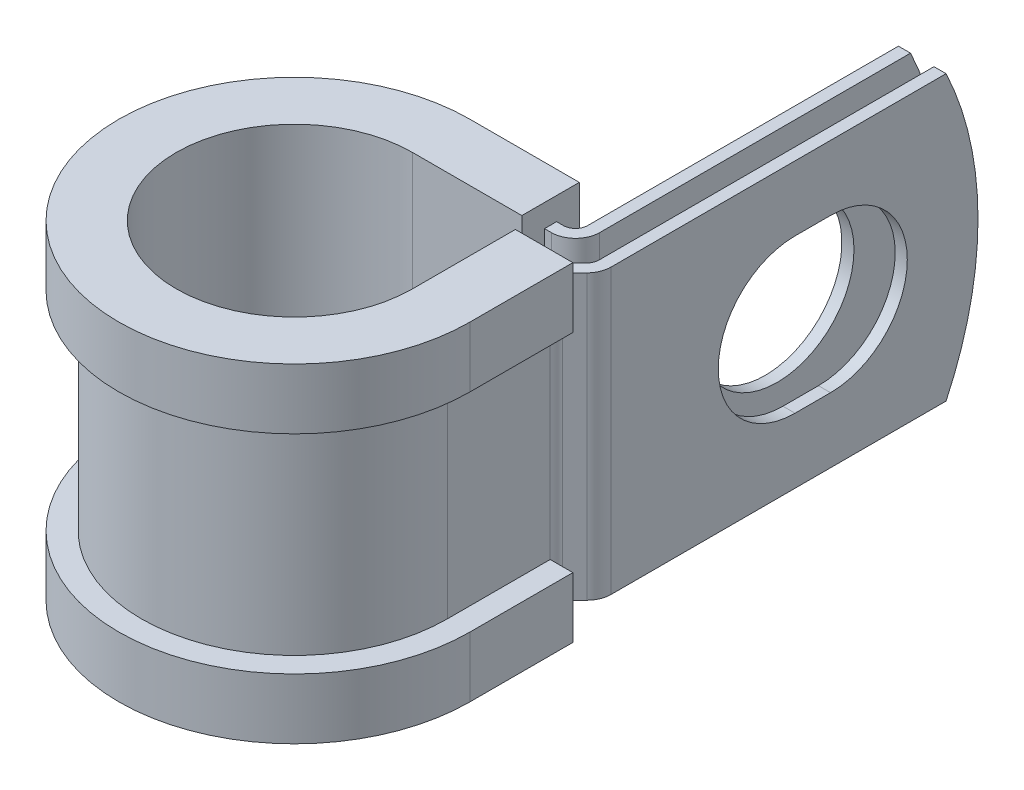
ISO-10303-21;
HEADER;
FILE_DESCRIPTION(('STEP AP214'),'2;1');
FILE_NAME('part.step','',(''),(''),'','','');
FILE_SCHEMA(('AUTOMOTIVE_DESIGN { 1 0 10303 214 1 1 1 1 }'));
ENDSEC;
DATA;
#1=APPLICATION_CONTEXT('core data for automotive mechanical design processes');
#2=APPLICATION_PROTOCOL_DEFINITION('international standard','automotive_design',2000,#1);
#3=PRODUCT_CONTEXT('',#1,'mechanical');
#4=PRODUCT('Part','Part','',(#3));
#5=PRODUCT_RELATED_PRODUCT_CATEGORY('part','',(#4));
#6=PRODUCT_DEFINITION_FORMATION('','',#4);
#7=PRODUCT_DEFINITION_CONTEXT('part definition',#1,'design');
#8=PRODUCT_DEFINITION('design','',#6,#7);
#9=PRODUCT_DEFINITION_SHAPE('','',#8);
#10=(LENGTH_UNIT() NAMED_UNIT(*) SI_UNIT(.MILLI.,.METRE.));
#11=(NAMED_UNIT(*) PLANE_ANGLE_UNIT() SI_UNIT($,.RADIAN.));
#12=(NAMED_UNIT(*) SI_UNIT($,.STERADIAN.) SOLID_ANGLE_UNIT());
#13=UNCERTAINTY_MEASURE_WITH_UNIT(LENGTH_MEASURE(1.E-05),#10,'distance_accuracy_value','');
#14=(GEOMETRIC_REPRESENTATION_CONTEXT(3) GLOBAL_UNCERTAINTY_ASSIGNED_CONTEXT((#13)) GLOBAL_UNIT_ASSIGNED_CONTEXT((#10,
#11,#12)) REPRESENTATION_CONTEXT('',''));
#15=CARTESIAN_POINT('',(0.,0.,0.));
#16=DIRECTION('',(0.,0.,1.));
#17=DIRECTION('',(1.,0.,0.));
#18=AXIS2_PLACEMENT_3D('',#15,#16,#17);
#19=CARTESIAN_POINT('',(10.1890743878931,-9.525,-9.4615));
#20=DIRECTION('',(0.,1.,0.));
#21=DIRECTION('',(1.,0.,0.));
#22=AXIS2_PLACEMENT_3D('',#19,#20,#21);
#23=PLANE('',#22);
#24=DIRECTION('',(0.,0.,-1.));
#25=VECTOR('',#24,1.);
#26=CARTESIAN_POINT('',(7.34427438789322,-9.525,-9.4615));
#27=LINE('',#26,#25);
#28=CARTESIAN_POINT('',(7.34427438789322,-9.525,-9.4615));
#29=VERTEX_POINT('',#28);
#30=CARTESIAN_POINT('',(7.34427438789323,-9.525,-10.2743));
#31=VERTEX_POINT('',#30);
#32=EDGE_CURVE('E523',#29,#31,#27,.T.);
#33=ORIENTED_EDGE('',*,*,#32,.T.);
#34=DIRECTION('',(-1.,0.,0.));
#35=VECTOR('',#34,1.);
#36=CARTESIAN_POINT('',(0.,-9.525,-10.2743));
#37=LINE('',#36,#35);
#38=CARTESIAN_POINT('',(7.80147438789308,-9.525,-10.2743));
#39=VERTEX_POINT('',#38);
#40=EDGE_CURVE('E410',#39,#31,#37,.T.);
#41=ORIENTED_EDGE('',*,*,#40,.F.);
#42=CARTESIAN_POINT('',(7.80147438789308,-9.525,-11.0871));
#43=DIRECTION('',(0.,1.,0.));
#44=DIRECTION('',(1.,0.,0.));
#45=AXIS2_PLACEMENT_3D('',#42,#43,#44);
#46=CIRCLE('',#45,0.812799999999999);
#47=CARTESIAN_POINT('',(8.61427438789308,-9.525,-11.0871));
#48=VERTEX_POINT('',#47);
#49=EDGE_CURVE('E408',#48,#39,#46,.F.);
#50=ORIENTED_EDGE('',*,*,#49,.F.);
#51=DIRECTION('',(0.,0.,1.));
#52=VECTOR('',#51,1.);
#53=CARTESIAN_POINT('',(8.61427438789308,-9.525,-34.1122));
#54=LINE('',#53,#52);
#55=CARTESIAN_POINT('',(8.61427438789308,-9.525,-31.9676631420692));
#56=VERTEX_POINT('',#55);
#57=EDGE_CURVE('E406',#56,#48,#54,.T.);
#58=ORIENTED_EDGE('',*,*,#57,.F.);
#59=DIRECTION('',(-1.,0.,0.));
#60=VECTOR('',#59,1.);
#61=CARTESIAN_POINT('',(11.8146743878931,-9.525,-31.9676631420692));
#62=LINE('',#61,#60);
#63=CARTESIAN_POINT('',(9.42707438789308,-9.525,-31.9676631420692));
#64=VERTEX_POINT('',#63);
#65=EDGE_CURVE('E12',#64,#56,#62,.T.);
#66=ORIENTED_EDGE('',*,*,#65,.F.);
#67=DIRECTION('',(0.,0.,1.));
#68=VECTOR('',#67,1.);
#69=CARTESIAN_POINT('',(9.42707438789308,-9.525,-34.1122));
#70=LINE('',#69,#68);
#71=CARTESIAN_POINT('',(9.42707438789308,-9.525,-11.0871));
#72=VERTEX_POINT('',#71);
#73=EDGE_CURVE('E404',#64,#72,#70,.T.);
#74=ORIENTED_EDGE('',*,*,#73,.T.);
#75=CARTESIAN_POINT('',(7.80147438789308,-9.525,-11.0871));
#76=DIRECTION('',(0.,-1.,0.));
#77=DIRECTION('',(0.,0.,1.));
#78=AXIS2_PLACEMENT_3D('',#75,#76,#77);
#79=CIRCLE('',#78,1.6256);
#80=CARTESIAN_POINT('',(7.80147438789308,-9.525,-9.4615));
#81=VERTEX_POINT('',#80);
#82=EDGE_CURVE('E401',#72,#81,#79,.T.);
#83=ORIENTED_EDGE('',*,*,#82,.T.);
#84=DIRECTION('',(-1.,0.,0.));
#85=VECTOR('',#84,1.);
#86=CARTESIAN_POINT('',(0.,-9.525,-9.4615));
#87=LINE('',#86,#85);
#88=EDGE_CURVE('E398',#81,#29,#87,.T.);
#89=ORIENTED_EDGE('',*,*,#88,.T.);
#90=EDGE_LOOP('',(#33,#41,#50,#58,#66,#74,#83,#89));
#91=FACE_BOUND('',#90,.T.);
#92=ADVANCED_FACE('F54',(#91),#23,.F.);
#93=CARTESIAN_POINT('',(10.1890743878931,9.525,-9.4615));
#94=DIRECTION('',(0.,1.,0.));
#95=DIRECTION('',(1.,0.,0.));
#96=AXIS2_PLACEMENT_3D('',#93,#94,#95);
#97=PLANE('',#96);
#98=DIRECTION('',(-1.,0.,0.));
#99=VECTOR('',#98,1.);
#100=CARTESIAN_POINT('',(0.,9.525,-10.2743));
#101=LINE('',#100,#99);
#102=CARTESIAN_POINT('',(7.80147438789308,9.525,-10.2743));
#103=VERTEX_POINT('',#102);
#104=CARTESIAN_POINT('',(7.34427438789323,9.525,-10.2743));
#105=VERTEX_POINT('',#104);
#106=EDGE_CURVE('E368',#103,#105,#101,.T.);
#107=ORIENTED_EDGE('',*,*,#106,.T.);
#108=DIRECTION('',(0.,0.,1.));
#109=VECTOR('',#108,1.);
#110=CARTESIAN_POINT('',(7.34427438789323,9.525,-10.2743));
#111=LINE('',#110,#109);
#112=CARTESIAN_POINT('',(7.34427438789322,9.525,-9.4615));
#113=VERTEX_POINT('',#112);
#114=EDGE_CURVE('E517',#105,#113,#111,.T.);
#115=ORIENTED_EDGE('',*,*,#114,.T.);
#116=DIRECTION('',(-1.,0.,0.));
#117=VECTOR('',#116,1.);
#118=CARTESIAN_POINT('',(0.,9.525,-9.4615));
#119=LINE('',#118,#117);
#120=CARTESIAN_POINT('',(7.80147438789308,9.525,-9.4615));
#121=VERTEX_POINT('',#120);
#122=EDGE_CURVE('E625',#121,#113,#119,.T.);
#123=ORIENTED_EDGE('',*,*,#122,.F.);
#124=CARTESIAN_POINT('',(7.80147438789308,9.525,-11.0871));
#125=DIRECTION('',(0.,-1.,0.));
#126=DIRECTION('',(0.,0.,1.));
#127=AXIS2_PLACEMENT_3D('',#124,#125,#126);
#128=CIRCLE('',#127,1.6256);
#129=CARTESIAN_POINT('',(9.42707438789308,9.525,-11.0871));
#130=VERTEX_POINT('',#129);
#131=EDGE_CURVE('E370',#130,#121,#128,.T.);
#132=ORIENTED_EDGE('',*,*,#131,.F.);
#133=DIRECTION('',(0.,0.,1.));
#134=VECTOR('',#133,1.);
#135=CARTESIAN_POINT('',(9.42707438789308,9.525,-34.1122));
#136=LINE('',#135,#134);
#137=CARTESIAN_POINT('',(9.42707438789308,9.525,-31.9676631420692));
#138=VERTEX_POINT('',#137);
#139=EDGE_CURVE('E361',#138,#130,#136,.T.);
#140=ORIENTED_EDGE('',*,*,#139,.F.);
#141=DIRECTION('',(-1.,0.,0.));
#142=VECTOR('',#141,1.);
#143=CARTESIAN_POINT('',(11.8146743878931,9.525,-31.9676631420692));
#144=LINE('',#143,#142);
#145=CARTESIAN_POINT('',(8.61427438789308,9.525,-31.9676631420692));
#146=VERTEX_POINT('',#145);
#147=EDGE_CURVE('E62',#138,#146,#144,.T.);
#148=ORIENTED_EDGE('',*,*,#147,.T.);
#149=DIRECTION('',(0.,0.,1.));
#150=VECTOR('',#149,1.);
#151=CARTESIAN_POINT('',(8.61427438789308,9.525,-34.1122));
#152=LINE('',#151,#150);
#153=CARTESIAN_POINT('',(8.61427438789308,9.525,-11.0871));
#154=VERTEX_POINT('',#153);
#155=EDGE_CURVE('E358',#146,#154,#152,.T.);
#156=ORIENTED_EDGE('',*,*,#155,.T.);
#157=CARTESIAN_POINT('',(7.80147438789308,9.525,-11.0871));
#158=DIRECTION('',(0.,1.,0.));
#159=DIRECTION('',(1.,0.,0.));
#160=AXIS2_PLACEMENT_3D('',#157,#158,#159);
#161=CIRCLE('',#160,0.812799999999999);
#162=EDGE_CURVE('E366',#154,#103,#161,.F.);
#163=ORIENTED_EDGE('',*,*,#162,.T.);
#164=EDGE_LOOP('',(#107,#115,#123,#132,#140,#148,#156,#163));
#165=FACE_BOUND('',#164,.T.);
#166=ADVANCED_FACE('F357',(#165),#97,.T.);
#167=CARTESIAN_POINT('',(0.,9.525,-9.4615));
#168=DIRECTION('',(0.,0.,1.));
#169=DIRECTION('',(1.,0.,0.));
#170=AXIS2_PLACEMENT_3D('',#167,#168,#169);
#171=PLANE('',#170);
#172=ORIENTED_EDGE('',*,*,#122,.T.);
#173=DIRECTION('',(0.,-1.,0.));
#174=VECTOR('',#173,1.);
#175=CARTESIAN_POINT('',(7.34427438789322,9.525,-9.4615));
#176=LINE('',#175,#174);
#177=EDGE_CURVE('E520',#113,#29,#176,.T.);
#178=ORIENTED_EDGE('',*,*,#177,.T.);
#179=ORIENTED_EDGE('',*,*,#88,.F.);
#180=DIRECTION('',(0.,-1.,0.));
#181=VECTOR('',#180,1.);
#182=CARTESIAN_POINT('',(7.80147438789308,9.525,-9.4615));
#183=LINE('',#182,#181);
#184=EDGE_CURVE('E344',#121,#81,#183,.T.);
#185=ORIENTED_EDGE('',*,*,#184,.F.);
#186=EDGE_LOOP('',(#172,#178,#179,#185));
#187=FACE_BOUND('',#186,.T.);
#188=ADVANCED_FACE('F635',(#187),#171,.T.);
#189=CARTESIAN_POINT('',(11.8146743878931,9.525,-9.4615));
#190=DIRECTION('',(-1.,0.,0.));
#191=DIRECTION('',(0.,0.,1.));
#192=AXIS2_PLACEMENT_3D('',#189,#190,#191);
#193=PLANE('',#192);
#194=CARTESIAN_POINT('',(11.8146743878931,0.,-24.2061999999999));
#195=DIRECTION('',(1.,0.,0.));
#196=DIRECTION('',(0.,0.,-1.));
#197=AXIS2_PLACEMENT_3D('',#194,#195,#196);
#198=CIRCLE('',#197,5.1562);
#199=CARTESIAN_POINT('',(11.8146743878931,-5.1562,-24.2062000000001));
#200=VERTEX_POINT('',#199);
#201=CARTESIAN_POINT('',(11.8146743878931,5.1562,-24.2062000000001));
#202=VERTEX_POINT('',#201);
#203=EDGE_CURVE('E580',#200,#202,#198,.T.);
#204=ORIENTED_EDGE('',*,*,#203,.F.);
#205=DIRECTION('',(0.,0.,-1.));
#206=VECTOR('',#205,1.);
#207=CARTESIAN_POINT('',(11.8146743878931,-5.1562,-21.8185999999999));
#208=LINE('',#207,#206);
#209=CARTESIAN_POINT('',(11.8146743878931,-5.1562,-21.8185999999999));
#210=VERTEX_POINT('',#209);
#211=EDGE_CURVE('E583',#210,#200,#208,.T.);
#212=ORIENTED_EDGE('',*,*,#211,.F.);
#213=CARTESIAN_POINT('',(11.8146743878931,0.,-21.8185999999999));
#214=DIRECTION('',(1.,0.,0.));
#215=DIRECTION('',(0.,0.,-1.));
#216=AXIS2_PLACEMENT_3D('',#213,#214,#215);
#217=CIRCLE('',#216,5.1562);
#218=CARTESIAN_POINT('',(11.8146743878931,5.1562,-21.8185999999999));
#219=VERTEX_POINT('',#218);
#220=EDGE_CURVE('E576',#219,#210,#217,.T.);
#221=ORIENTED_EDGE('',*,*,#220,.F.);
#222=DIRECTION('',(0.,0.,1.));
#223=VECTOR('',#222,1.);
#224=CARTESIAN_POINT('',(11.8146743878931,5.1562,-21.8185999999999));
#225=LINE('',#224,#223);
#226=EDGE_CURVE('E577',#202,#219,#225,.T.);
#227=ORIENTED_EDGE('',*,*,#226,.F.);
#228=EDGE_LOOP('',(#204,#212,#221,#227));
#229=FACE_BOUND('',#228,.T.);
#230=DIRECTION('',(0.,0.,-1.));
#231=VECTOR('',#230,1.);
#232=CARTESIAN_POINT('',(11.8146743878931,-9.525,-9.4615));
#233=LINE('',#232,#231);
#234=CARTESIAN_POINT('',(11.8146743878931,-9.525,-9.4615));
#235=VERTEX_POINT('',#234);
#236=CARTESIAN_POINT('',(11.8146743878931,-9.525,-31.9676631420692));
#237=VERTEX_POINT('',#236);
#238=EDGE_CURVE('E382',#235,#237,#233,.T.);
#239=ORIENTED_EDGE('',*,*,#238,.T.);
#240=CARTESIAN_POINT('',(11.8146743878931,0.,-11.8872));
#241=DIRECTION('',(-1.,0.,0.));
#242=DIRECTION('',(0.,0.,1.));
#243=AXIS2_PLACEMENT_3D('',#240,#241,#242);
#244=CIRCLE('',#243,22.225);
#245=CARTESIAN_POINT('',(11.8146743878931,9.525,-31.9676631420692));
#246=VERTEX_POINT('',#245);
#247=EDGE_CURVE('E568',#246,#237,#244,.T.);
#248=ORIENTED_EDGE('',*,*,#247,.F.);
#249=DIRECTION('',(0.,0.,-1.));
#250=VECTOR('',#249,1.);
#251=CARTESIAN_POINT('',(11.8146743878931,9.525,-9.4615));
#252=LINE('',#251,#250);
#253=CARTESIAN_POINT('',(11.8146743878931,9.525,-9.4615));
#254=VERTEX_POINT('',#253);
#255=EDGE_CURVE('E419',#254,#246,#252,.T.);
#256=ORIENTED_EDGE('',*,*,#255,.F.);
#257=DIRECTION('',(0.,-1.,0.));
#258=VECTOR('',#257,1.);
#259=CARTESIAN_POINT('',(11.8146743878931,9.525,-9.4615));
#260=LINE('',#259,#258);
#261=EDGE_CURVE('E381',#254,#235,#260,.T.);
#262=ORIENTED_EDGE('',*,*,#261,.T.);
#263=EDGE_LOOP('',(#239,#248,#256,#262));
#264=FACE_BOUND('',#263,.T.);
#265=ADVANCED_FACE('F56',(#229,#264),#193,.F.);
#266=CARTESIAN_POINT('',(11.0018743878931,9.525,-9.4615));
#267=DIRECTION('',(-1.,0.,0.));
#268=DIRECTION('',(0.,0.,1.));
#269=AXIS2_PLACEMENT_3D('',#266,#267,#268);
#270=PLANE('',#269);
#271=DIRECTION('',(0.,0.,-1.));
#272=VECTOR('',#271,1.);
#273=CARTESIAN_POINT('',(11.0018743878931,-5.1562,-21.8185999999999));
#274=LINE('',#273,#272);
#275=CARTESIAN_POINT('',(11.0018743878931,-5.1562,-21.8185999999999));
#276=VERTEX_POINT('',#275);
#277=CARTESIAN_POINT('',(11.0018743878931,-5.1562,-24.2062000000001));
#278=VERTEX_POINT('',#277);
#279=EDGE_CURVE('E579',#276,#278,#274,.T.);
#280=ORIENTED_EDGE('',*,*,#279,.T.);
#281=CARTESIAN_POINT('',(11.0018743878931,0.,-24.2061999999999));
#282=DIRECTION('',(-1.,0.,0.));
#283=DIRECTION('',(0.,0.,1.));
#284=AXIS2_PLACEMENT_3D('',#281,#282,#283);
#285=CIRCLE('',#284,5.1562);
#286=CARTESIAN_POINT('',(11.0018743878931,5.1562,-24.2062000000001));
#287=VERTEX_POINT('',#286);
#288=EDGE_CURVE('E600',#278,#287,#285,.F.);
#289=ORIENTED_EDGE('',*,*,#288,.T.);
#290=DIRECTION('',(0.,0.,1.));
#291=VECTOR('',#290,1.);
#292=CARTESIAN_POINT('',(11.0018743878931,5.1562,-21.8185999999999));
#293=LINE('',#292,#291);
#294=CARTESIAN_POINT('',(11.0018743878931,5.1562,-21.8185999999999));
#295=VERTEX_POINT('',#294);
#296=EDGE_CURVE('E596',#287,#295,#293,.T.);
#297=ORIENTED_EDGE('',*,*,#296,.T.);
#298=CARTESIAN_POINT('',(11.0018743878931,0.,-21.8185999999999));
#299=DIRECTION('',(-1.,0.,0.));
#300=DIRECTION('',(0.,0.,1.));
#301=AXIS2_PLACEMENT_3D('',#298,#299,#300);
#302=CIRCLE('',#301,5.1562);
#303=EDGE_CURVE('E591',#295,#276,#302,.F.);
#304=ORIENTED_EDGE('',*,*,#303,.T.);
#305=EDGE_LOOP('',(#280,#289,#297,#304));
#306=FACE_BOUND('',#305,.T.);
#307=CARTESIAN_POINT('',(11.0018743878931,0.,-11.8872));
#308=DIRECTION('',(-1.,0.,0.));
#309=DIRECTION('',(0.,0.,1.));
#310=AXIS2_PLACEMENT_3D('',#307,#308,#309);
#311=CIRCLE('',#310,22.225);
#312=CARTESIAN_POINT('',(11.0018743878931,9.525,-31.9676631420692));
#313=VERTEX_POINT('',#312);
#314=CARTESIAN_POINT('',(11.0018743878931,-9.525,-31.9676631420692));
#315=VERTEX_POINT('',#314);
#316=EDGE_CURVE('E76',#313,#315,#311,.T.);
#317=ORIENTED_EDGE('',*,*,#316,.T.);
#318=DIRECTION('',(0.,0.,-1.));
#319=VECTOR('',#318,1.);
#320=CARTESIAN_POINT('',(11.0018743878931,-9.525,-9.4615));
#321=LINE('',#320,#319);
#322=CARTESIAN_POINT('',(11.0018743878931,-9.525,-9.4615));
#323=VERTEX_POINT('',#322);
#324=EDGE_CURVE('E385',#323,#315,#321,.T.);
#325=ORIENTED_EDGE('',*,*,#324,.F.);
#326=DIRECTION('',(0.,-1.,0.));
#327=VECTOR('',#326,1.);
#328=CARTESIAN_POINT('',(11.0018743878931,9.525,-9.4615));
#329=LINE('',#328,#327);
#330=CARTESIAN_POINT('',(11.0018743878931,9.525,-9.4615));
#331=VERTEX_POINT('',#330);
#332=EDGE_CURVE('E352',#331,#323,#329,.T.);
#333=ORIENTED_EDGE('',*,*,#332,.F.);
#334=DIRECTION('',(0.,0.,-1.));
#335=VECTOR('',#334,1.);
#336=CARTESIAN_POINT('',(11.0018743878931,9.525,-9.4615));
#337=LINE('',#336,#335);
#338=EDGE_CURVE('E615',#331,#313,#337,.T.);
#339=ORIENTED_EDGE('',*,*,#338,.T.);
#340=EDGE_LOOP('',(#317,#325,#333,#339));
#341=FACE_BOUND('',#340,.T.);
#342=ADVANCED_FACE('F689',(#306,#341),#270,.T.);
#343=CARTESIAN_POINT('',(9.42707438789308,9.525,-34.1122));
#344=DIRECTION('',(1.,0.,0.));
#345=DIRECTION('',(0.,0.,-1.));
#346=AXIS2_PLACEMENT_3D('',#343,#344,#345);
#347=PLANE('',#346);
#348=CARTESIAN_POINT('',(9.42707438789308,0.,-23.0124));
#349=DIRECTION('',(1.,0.,0.));
#350=DIRECTION('',(0.,0.,-1.));
#351=AXIS2_PLACEMENT_3D('',#348,#349,#350);
#352=CIRCLE('',#351,5.1562);
#353=CARTESIAN_POINT('',(9.42707438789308,0.,-28.1686));
#354=VERTEX_POINT('',#353);
#355=EDGE_CURVE('E386',#354,#354,#352,.F.);
#356=ORIENTED_EDGE('',*,*,#355,.T.);
#357=EDGE_LOOP('',(#356));
#358=FACE_BOUND('',#357,.T.);
#359=ORIENTED_EDGE('',*,*,#73,.F.);
#360=CARTESIAN_POINT('',(9.42707438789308,0.,-11.8872));
#361=DIRECTION('',(1.,0.,0.));
#362=DIRECTION('',(0.,0.,-1.));
#363=AXIS2_PLACEMENT_3D('',#360,#361,#362);
#364=CIRCLE('',#363,22.225);
#365=EDGE_CURVE('E573',#64,#138,#364,.T.);
#366=ORIENTED_EDGE('',*,*,#365,.T.);
#367=ORIENTED_EDGE('',*,*,#139,.T.);
#368=DIRECTION('',(0.,-1.,0.));
#369=VECTOR('',#368,1.);
#370=CARTESIAN_POINT('',(9.42707438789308,9.525,-11.0871));
#371=LINE('',#370,#369);
#372=EDGE_CURVE('E341',#130,#72,#371,.T.);
#373=ORIENTED_EDGE('',*,*,#372,.T.);
#374=EDGE_LOOP('',(#359,#366,#367,#373));
#375=FACE_BOUND('',#374,.T.);
#376=ADVANCED_FACE('F641',(#358,#375),#347,.T.);
#377=CARTESIAN_POINT('',(8.61427438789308,9.525,-34.1122));
#378=DIRECTION('',(1.,0.,0.));
#379=DIRECTION('',(0.,0.,-1.));
#380=AXIS2_PLACEMENT_3D('',#377,#378,#379);
#381=PLANE('',#380);
#382=CARTESIAN_POINT('',(8.61427438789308,0.,-23.0124));
#383=DIRECTION('',(-1.,0.,0.));
#384=DIRECTION('',(0.,0.,1.));
#385=AXIS2_PLACEMENT_3D('',#382,#383,#384);
#386=CIRCLE('',#385,5.1562);
#387=CARTESIAN_POINT('',(8.61427438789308,0.,-17.8562));
#388=VERTEX_POINT('',#387);
#389=EDGE_CURVE('E608',#388,#388,#386,.T.);
#390=ORIENTED_EDGE('',*,*,#389,.F.);
#391=EDGE_LOOP('',(#390));
#392=FACE_BOUND('',#391,.T.);
#393=CARTESIAN_POINT('',(8.61427438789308,0.,-11.8872));
#394=DIRECTION('',(-1.,0.,0.));
#395=DIRECTION('',(0.,0.,1.));
#396=AXIS2_PLACEMENT_3D('',#393,#394,#395);
#397=CIRCLE('',#396,22.225);
#398=EDGE_CURVE('E68',#146,#56,#397,.T.);
#399=ORIENTED_EDGE('',*,*,#398,.T.);
#400=ORIENTED_EDGE('',*,*,#57,.T.);
#401=DIRECTION('',(0.,-1.,0.));
#402=VECTOR('',#401,1.);
#403=CARTESIAN_POINT('',(8.61427438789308,9.525,-11.0871));
#404=LINE('',#403,#402);
#405=EDGE_CURVE('E338',#154,#48,#404,.T.);
#406=ORIENTED_EDGE('',*,*,#405,.F.);
#407=ORIENTED_EDGE('',*,*,#155,.F.);
#408=EDGE_LOOP('',(#399,#400,#406,#407));
#409=FACE_BOUND('',#408,.T.);
#410=ADVANCED_FACE('F364',(#392,#409),#381,.F.);
#411=CARTESIAN_POINT('',(11.0871,-9.525,-6.91110726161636));
#412=DIRECTION('',(0.,1.,0.));
#413=DIRECTION('',(1.,0.,0.));
#414=AXIS2_PLACEMENT_3D('',#411,#412,#413);
#415=CIRCLE('',#414,0.8128);
#416=CARTESIAN_POINT('',(10.2743,-9.525,-6.91110726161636));
#417=VERTEX_POINT('',#416);
#418=CARTESIAN_POINT('',(10.5123636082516,-9.525,-7.48584365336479));
#419=VERTEX_POINT('',#418);
#420=EDGE_CURVE('E413',#417,#419,#415,.F.);
#421=ORIENTED_EDGE('',*,*,#420,.F.);
#422=DIRECTION('',(1.,0.,0.));
#423=VECTOR('',#422,1.);
#424=CARTESIAN_POINT('',(9.4615,-9.525,-6.91110726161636));
#425=LINE('',#424,#423);
#426=CARTESIAN_POINT('',(9.4615,-9.525,-6.91110726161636));
#427=VERTEX_POINT('',#426);
#428=EDGE_CURVE('E451',#427,#417,#425,.T.);
#429=ORIENTED_EDGE('',*,*,#428,.F.);
#430=CARTESIAN_POINT('',(11.0871,-9.525,-6.91110726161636));
#431=DIRECTION('',(0.,-1.,0.));
#432=DIRECTION('',(0.,0.,1.));
#433=AXIS2_PLACEMENT_3D('',#430,#431,#432);
#434=CIRCLE('',#433,1.6256);
#435=CARTESIAN_POINT('',(9.93762721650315,-9.525,-8.06058004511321));
#436=VERTEX_POINT('',#435);
#437=EDGE_CURVE('E395',#427,#436,#434,.T.);
#438=ORIENTED_EDGE('',*,*,#437,.T.);
#439=DIRECTION('',(0.707106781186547,0.,-0.707106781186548));
#440=VECTOR('',#439,1.);
#441=CARTESIAN_POINT('',(9.93762721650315,-9.525,-8.06058004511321));
#442=LINE('',#441,#440);
#443=CARTESIAN_POINT('',(10.7638107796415,-9.525,-8.88676360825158));
#444=VERTEX_POINT('',#443);
#445=EDGE_CURVE('E392',#436,#444,#442,.T.);
#446=ORIENTED_EDGE('',*,*,#445,.T.);
#447=CARTESIAN_POINT('',(10.1890743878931,-9.525,-9.4615));
#448=DIRECTION('',(0.,1.,0.));
#449=DIRECTION('',(0.,0.,1.));
#450=AXIS2_PLACEMENT_3D('',#447,#448,#449);
#451=CIRCLE('',#450,0.812799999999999);
#452=EDGE_CURVE('E389',#444,#323,#451,.T.);
#453=ORIENTED_EDGE('',*,*,#452,.T.);
#454=ORIENTED_EDGE('',*,*,#324,.T.);
#455=DIRECTION('',(-1.,0.,0.));
#456=VECTOR('',#455,1.);
#457=CARTESIAN_POINT('',(11.8146743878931,-9.525,-31.9676631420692));
#458=LINE('',#457,#456);
#459=EDGE_CURVE('E566',#237,#315,#458,.T.);
#460=ORIENTED_EDGE('',*,*,#459,.F.);
#461=ORIENTED_EDGE('',*,*,#238,.F.);
#462=CARTESIAN_POINT('',(10.1890743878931,-9.525,-9.4615));
#463=DIRECTION('',(0.,1.,0.));
#464=DIRECTION('',(1.,0.,0.));
#465=AXIS2_PLACEMENT_3D('',#462,#463,#464);
#466=CIRCLE('',#465,1.6256);
#467=CARTESIAN_POINT('',(11.3385471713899,-9.525,-8.31202721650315));
#468=VERTEX_POINT('',#467);
#469=EDGE_CURVE('E417',#468,#235,#466,.T.);
#470=ORIENTED_EDGE('',*,*,#469,.F.);
#471=DIRECTION('',(0.707106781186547,0.,-0.707106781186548));
#472=VECTOR('',#471,1.);
#473=CARTESIAN_POINT('',(10.5123636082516,-9.525,-7.48584365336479));
#474=LINE('',#473,#472);
#475=EDGE_CURVE('E415',#419,#468,#474,.T.);
#476=ORIENTED_EDGE('',*,*,#475,.F.);
#477=EDGE_LOOP('',(#421,#429,#438,#446,#453,#454,#460,#461,#470,#476));
#478=FACE_BOUND('',#477,.T.);
#479=ADVANCED_FACE('F675',(#478),#23,.F.);
#480=DIRECTION('',(-1.,0.,0.));
#481=VECTOR('',#480,1.);
#482=CARTESIAN_POINT('',(10.2743,9.525,-6.91110726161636));
#483=LINE('',#482,#481);
#484=CARTESIAN_POINT('',(10.2743,9.525,-6.91110726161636));
#485=VERTEX_POINT('',#484);
#486=CARTESIAN_POINT('',(9.4615,9.525,-6.91110726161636));
#487=VERTEX_POINT('',#486);
#488=EDGE_CURVE('E440',#485,#487,#483,.T.);
#489=ORIENTED_EDGE('',*,*,#488,.F.);
#490=CARTESIAN_POINT('',(11.0871,9.525,-6.91110726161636));
#491=DIRECTION('',(0.,1.,0.));
#492=DIRECTION('',(1.,0.,0.));
#493=AXIS2_PLACEMENT_3D('',#490,#491,#492);
#494=CIRCLE('',#493,0.8128);
#495=CARTESIAN_POINT('',(10.5123636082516,9.525,-7.48584365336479));
#496=VERTEX_POINT('',#495);
#497=EDGE_CURVE('E375',#485,#496,#494,.F.);
#498=ORIENTED_EDGE('',*,*,#497,.T.);
#499=DIRECTION('',(0.707106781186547,0.,-0.707106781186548));
#500=VECTOR('',#499,1.);
#501=CARTESIAN_POINT('',(10.5123636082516,9.525,-7.48584365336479));
#502=LINE('',#501,#500);
#503=CARTESIAN_POINT('',(11.3385471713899,9.525,-8.31202721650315));
#504=VERTEX_POINT('',#503);
#505=EDGE_CURVE('E377',#496,#504,#502,.T.);
#506=ORIENTED_EDGE('',*,*,#505,.T.);
#507=CARTESIAN_POINT('',(10.1890743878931,9.525,-9.4615));
#508=DIRECTION('',(0.,1.,0.));
#509=DIRECTION('',(1.,0.,0.));
#510=AXIS2_PLACEMENT_3D('',#507,#508,#509);
#511=CIRCLE('',#510,1.6256);
#512=EDGE_CURVE('E379',#504,#254,#511,.T.);
#513=ORIENTED_EDGE('',*,*,#512,.T.);
#514=ORIENTED_EDGE('',*,*,#255,.T.);
#515=DIRECTION('',(-1.,0.,0.));
#516=VECTOR('',#515,1.);
#517=CARTESIAN_POINT('',(11.8146743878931,9.525,-31.9676631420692));
#518=LINE('',#517,#516);
#519=EDGE_CURVE('E570',#246,#313,#518,.T.);
#520=ORIENTED_EDGE('',*,*,#519,.T.);
#521=ORIENTED_EDGE('',*,*,#338,.F.);
#522=CARTESIAN_POINT('',(10.1890743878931,9.525,-9.4615));
#523=DIRECTION('',(0.,1.,0.));
#524=DIRECTION('',(0.,0.,1.));
#525=AXIS2_PLACEMENT_3D('',#522,#523,#524);
#526=CIRCLE('',#525,0.812799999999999);
#527=CARTESIAN_POINT('',(10.7638107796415,9.525,-8.88676360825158));
#528=VERTEX_POINT('',#527);
#529=EDGE_CURVE('E618',#528,#331,#526,.T.);
#530=ORIENTED_EDGE('',*,*,#529,.F.);
#531=DIRECTION('',(0.707106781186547,0.,-0.707106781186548));
#532=VECTOR('',#531,1.);
#533=CARTESIAN_POINT('',(9.93762721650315,9.525,-8.06058004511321));
#534=LINE('',#533,#532);
#535=CARTESIAN_POINT('',(9.93762721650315,9.525,-8.06058004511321));
#536=VERTEX_POINT('',#535);
#537=EDGE_CURVE('E621',#536,#528,#534,.T.);
#538=ORIENTED_EDGE('',*,*,#537,.F.);
#539=CARTESIAN_POINT('',(11.0871,9.525,-6.91110726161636));
#540=DIRECTION('',(0.,-1.,0.));
#541=DIRECTION('',(0.,0.,1.));
#542=AXIS2_PLACEMENT_3D('',#539,#540,#541);
#543=CIRCLE('',#542,1.6256);
#544=EDGE_CURVE('E450',#487,#536,#543,.T.);
#545=ORIENTED_EDGE('',*,*,#544,.F.);
#546=EDGE_LOOP('',(#489,#498,#506,#513,#514,#520,#521,#530,#538,#545));
#547=FACE_BOUND('',#546,.T.);
#548=ADVANCED_FACE('F447',(#547),#97,.T.);
#549=CARTESIAN_POINT('',(10.1890743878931,9.525,-9.4615));
#550=DIRECTION('',(0.,-1.,0.));
#551=DIRECTION('',(0.,0.,-1.));
#552=AXIS2_PLACEMENT_3D('',#549,#550,#551);
#553=CYLINDRICAL_SURFACE('',#552,0.812799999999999);
#554=ORIENTED_EDGE('',*,*,#452,.F.);
#555=DIRECTION('',(0.,-1.,0.));
#556=VECTOR('',#555,1.);
#557=CARTESIAN_POINT('',(10.7638107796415,9.525,-8.88676360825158));
#558=LINE('',#557,#556);
#559=EDGE_CURVE('E350',#528,#444,#558,.T.);
#560=ORIENTED_EDGE('',*,*,#559,.F.);
#561=ORIENTED_EDGE('',*,*,#529,.T.);
#562=ORIENTED_EDGE('',*,*,#332,.T.);
#563=EDGE_LOOP('',(#554,#560,#561,#562));
#564=FACE_BOUND('',#563,.T.);
#565=ADVANCED_FACE('F685',(#564),#553,.F.);
#566=CARTESIAN_POINT('',(9.93762721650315,9.525,-8.06058004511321));
#567=DIRECTION('',(-0.707106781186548,0.,-0.707106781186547));
#568=DIRECTION('',(-0.707106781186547,0.,0.707106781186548));
#569=AXIS2_PLACEMENT_3D('',#566,#567,#568);
#570=PLANE('',#569);
#571=ORIENTED_EDGE('',*,*,#445,.F.);
#572=DIRECTION('',(0.,-1.,0.));
#573=VECTOR('',#572,1.);
#574=CARTESIAN_POINT('',(9.93762721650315,9.525,-8.06058004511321));
#575=LINE('',#574,#573);
#576=EDGE_CURVE('E348',#536,#436,#575,.T.);
#577=ORIENTED_EDGE('',*,*,#576,.F.);
#578=ORIENTED_EDGE('',*,*,#537,.T.);
#579=ORIENTED_EDGE('',*,*,#559,.T.);
#580=EDGE_LOOP('',(#571,#577,#578,#579));
#581=FACE_BOUND('',#580,.T.);
#582=ADVANCED_FACE('F680',(#581),#570,.T.);
#583=CARTESIAN_POINT('',(11.0871,9.525,-6.91110726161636));
#584=DIRECTION('',(0.,-1.,0.));
#585=DIRECTION('',(0.,0.,-1.));
#586=AXIS2_PLACEMENT_3D('',#583,#584,#585);
#587=CYLINDRICAL_SURFACE('',#586,1.6256);
#588=ORIENTED_EDGE('',*,*,#437,.F.);
#589=DIRECTION('',(0.,-1.,0.));
#590=VECTOR('',#589,1.);
#591=CARTESIAN_POINT('',(9.4615,9.525,-6.91110726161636));
#592=LINE('',#591,#590);
#593=EDGE_CURVE('E346',#487,#427,#592,.T.);
#594=ORIENTED_EDGE('',*,*,#593,.F.);
#595=ORIENTED_EDGE('',*,*,#544,.T.);
#596=ORIENTED_EDGE('',*,*,#576,.T.);
#597=EDGE_LOOP('',(#588,#594,#595,#596));
#598=FACE_BOUND('',#597,.T.);
#599=ADVANCED_FACE('F677',(#598),#587,.T.);
#600=CARTESIAN_POINT('',(7.80147438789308,9.525,-11.0871));
#601=DIRECTION('',(0.,-1.,0.));
#602=DIRECTION('',(0.,0.,-1.));
#603=AXIS2_PLACEMENT_3D('',#600,#601,#602);
#604=CYLINDRICAL_SURFACE('',#603,1.6256);
#605=ORIENTED_EDGE('',*,*,#82,.F.);
#606=ORIENTED_EDGE('',*,*,#372,.F.);
#607=ORIENTED_EDGE('',*,*,#131,.T.);
#608=ORIENTED_EDGE('',*,*,#184,.T.);
#609=EDGE_LOOP('',(#605,#606,#607,#608));
#610=FACE_BOUND('',#609,.T.);
#611=ADVANCED_FACE('F631',(#610),#604,.T.);
#612=CARTESIAN_POINT('',(7.80147438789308,9.525,-11.0871));
#613=DIRECTION('',(0.,-1.,0.));
#614=DIRECTION('',(0.,0.,-1.));
#615=AXIS2_PLACEMENT_3D('',#612,#613,#614);
#616=CYLINDRICAL_SURFACE('',#615,0.812799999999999);
#617=ORIENTED_EDGE('',*,*,#49,.T.);
#618=DIRECTION('',(0.,-1.,0.));
#619=VECTOR('',#618,1.);
#620=CARTESIAN_POINT('',(7.80147438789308,9.525,-10.2743));
#621=LINE('',#620,#619);
#622=EDGE_CURVE('E329',#103,#39,#621,.T.);
#623=ORIENTED_EDGE('',*,*,#622,.F.);
#624=ORIENTED_EDGE('',*,*,#162,.F.);
#625=ORIENTED_EDGE('',*,*,#405,.T.);
#626=EDGE_LOOP('',(#617,#623,#624,#625));
#627=FACE_BOUND('',#626,.T.);
#628=ADVANCED_FACE('F646',(#627),#616,.F.);
#629=CARTESIAN_POINT('',(0.,9.525,-10.2743));
#630=DIRECTION('',(0.,0.,1.));
#631=DIRECTION('',(1.,0.,0.));
#632=AXIS2_PLACEMENT_3D('',#629,#630,#631);
#633=PLANE('',#632);
#634=DIRECTION('',(0.,-1.,0.));
#635=VECTOR('',#634,1.);
#636=CARTESIAN_POINT('',(0.,9.525,-10.2743));
#637=LINE('',#636,#635);
#638=CARTESIAN_POINT('',(1.44119226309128E-13,6.985,-10.2743));
#639=VERTEX_POINT('',#638);
#640=CARTESIAN_POINT('',(1.44119226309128E-13,-6.985,-10.2743));
#641=VERTEX_POINT('',#640);
#642=EDGE_CURVE('E320',#639,#641,#637,.T.);
#643=ORIENTED_EDGE('',*,*,#642,.F.);
#644=DIRECTION('',(1.,0.,0.));
#645=VECTOR('',#644,1.);
#646=CARTESIAN_POINT('',(1.44119226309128E-13,6.985,-10.2743));
#647=LINE('',#646,#645);
#648=CARTESIAN_POINT('',(7.34427438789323,6.985,-10.2743));
#649=VERTEX_POINT('',#648);
#650=EDGE_CURVE('E563',#639,#649,#647,.T.);
#651=ORIENTED_EDGE('',*,*,#650,.T.);
#652=DIRECTION('',(0.,1.,0.));
#653=VECTOR('',#652,1.);
#654=CARTESIAN_POINT('',(7.34427438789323,9.525,-10.2743));
#655=LINE('',#654,#653);
#656=EDGE_CURVE('E514',#649,#105,#655,.T.);
#657=ORIENTED_EDGE('',*,*,#656,.T.);
#658=ORIENTED_EDGE('',*,*,#106,.F.);
#659=ORIENTED_EDGE('',*,*,#622,.T.);
#660=ORIENTED_EDGE('',*,*,#40,.T.);
#661=DIRECTION('',(0.,1.,0.));
#662=VECTOR('',#661,1.);
#663=CARTESIAN_POINT('',(7.34427438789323,-9.525,-10.2743));
#664=LINE('',#663,#662);
#665=CARTESIAN_POINT('',(7.34427438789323,-6.985,-10.2743));
#666=VERTEX_POINT('',#665);
#667=EDGE_CURVE('E526',#31,#666,#664,.T.);
#668=ORIENTED_EDGE('',*,*,#667,.T.);
#669=DIRECTION('',(1.,0.,0.));
#670=VECTOR('',#669,1.);
#671=CARTESIAN_POINT('',(1.44119226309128E-13,-6.985,-10.2743));
#672=LINE('',#671,#670);
#673=EDGE_CURVE('E543',#641,#666,#672,.T.);
#674=ORIENTED_EDGE('',*,*,#673,.F.);
#675=EDGE_LOOP('',(#643,#651,#657,#658,#659,#660,#668,#674));
#676=FACE_BOUND('',#675,.T.);
#677=ADVANCED_FACE('F650',(#676),#633,.F.);
#678=CARTESIAN_POINT('',(0.,9.525,0.));
#679=DIRECTION('',(0.,-1.,0.));
#680=DIRECTION('',(0.,0.,-1.));
#681=AXIS2_PLACEMENT_3D('',#678,#679,#680);
#682=CYLINDRICAL_SURFACE('',#681,10.2743);
#683=DIRECTION('',(0.,-1.,0.));
#684=VECTOR('',#683,1.);
#685=CARTESIAN_POINT('',(10.2743,9.525,0.));
#686=LINE('',#685,#684);
#687=CARTESIAN_POINT('',(10.2743,6.985,0.));
#688=VERTEX_POINT('',#687);
#689=CARTESIAN_POINT('',(10.2743,-6.985,0.));
#690=VERTEX_POINT('',#689);
#691=EDGE_CURVE('E318',#688,#690,#686,.T.);
#692=ORIENTED_EDGE('',*,*,#691,.F.);
#693=CARTESIAN_POINT('',(0.,6.985,0.));
#694=DIRECTION('',(0.,-1.,0.));
#695=DIRECTION('',(0.,0.,-1.));
#696=AXIS2_PLACEMENT_3D('',#693,#694,#695);
#697=CIRCLE('',#696,10.2743);
#698=EDGE_CURVE('E512',#688,#639,#697,.T.);
#699=ORIENTED_EDGE('',*,*,#698,.T.);
#700=ORIENTED_EDGE('',*,*,#642,.T.);
#701=CARTESIAN_POINT('',(0.,-6.985,0.));
#702=DIRECTION('',(0.,-1.,0.));
#703=DIRECTION('',(0.,0.,-1.));
#704=AXIS2_PLACEMENT_3D('',#701,#702,#703);
#705=CIRCLE('',#704,10.2743);
#706=EDGE_CURVE('E301',#690,#641,#705,.T.);
#707=ORIENTED_EDGE('',*,*,#706,.F.);
#708=EDGE_LOOP('',(#692,#699,#700,#707));
#709=FACE_BOUND('',#708,.T.);
#710=ADVANCED_FACE('F316',(#709),#682,.T.);
#711=CARTESIAN_POINT('',(10.2743,9.525,0.));
#712=DIRECTION('',(-1.,0.,0.));
#713=DIRECTION('',(0.,0.,1.));
#714=AXIS2_PLACEMENT_3D('',#711,#712,#713);
#715=PLANE('',#714);
#716=DIRECTION('',(0.,-1.,0.));
#717=VECTOR('',#716,1.);
#718=CARTESIAN_POINT('',(10.2743,9.525,-6.91110726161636));
#719=LINE('',#718,#717);
#720=CARTESIAN_POINT('',(10.2743,6.985,-6.91110726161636));
#721=VERTEX_POINT('',#720);
#722=CARTESIAN_POINT('',(10.2743,-6.985,-6.91110726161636));
#723=VERTEX_POINT('',#722);
#724=EDGE_CURVE('E332',#721,#723,#719,.T.);
#725=ORIENTED_EDGE('',*,*,#724,.F.);
#726=DIRECTION('',(0.,0.,-1.));
#727=VECTOR('',#726,1.);
#728=CARTESIAN_POINT('',(10.2743,6.985,0.));
#729=LINE('',#728,#727);
#730=EDGE_CURVE('E326',#688,#721,#729,.T.);
#731=ORIENTED_EDGE('',*,*,#730,.F.);
#732=ORIENTED_EDGE('',*,*,#691,.T.);
#733=DIRECTION('',(0.,0.,-1.));
#734=VECTOR('',#733,1.);
#735=CARTESIAN_POINT('',(10.2743,-6.985,0.));
#736=LINE('',#735,#734);
#737=EDGE_CURVE('E297',#690,#723,#736,.T.);
#738=ORIENTED_EDGE('',*,*,#737,.T.);
#739=EDGE_LOOP('',(#725,#731,#732,#738));
#740=FACE_BOUND('',#739,.T.);
#741=ADVANCED_FACE('F325',(#740),#715,.F.);
#742=CARTESIAN_POINT('',(11.0871,9.525,-6.91110726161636));
#743=DIRECTION('',(0.,-1.,0.));
#744=DIRECTION('',(0.,0.,-1.));
#745=AXIS2_PLACEMENT_3D('',#742,#743,#744);
#746=CYLINDRICAL_SURFACE('',#745,0.8128);
#747=ORIENTED_EDGE('',*,*,#420,.T.);
#748=DIRECTION('',(0.,-1.,0.));
#749=VECTOR('',#748,1.);
#750=CARTESIAN_POINT('',(10.5123636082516,9.525,-7.48584365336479));
#751=LINE('',#750,#749);
#752=EDGE_CURVE('E424',#496,#419,#751,.T.);
#753=ORIENTED_EDGE('',*,*,#752,.F.);
#754=ORIENTED_EDGE('',*,*,#497,.F.);
#755=EDGE_CURVE('E327',#485,#721,#719,.T.);
#756=ORIENTED_EDGE('',*,*,#755,.T.);
#757=ORIENTED_EDGE('',*,*,#724,.T.);
#758=DIRECTION('',(0.,1.,0.));
#759=VECTOR('',#758,1.);
#760=CARTESIAN_POINT('',(10.2743,-9.525,-6.91110726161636));
#761=LINE('',#760,#759);
#762=EDGE_CURVE('E433',#417,#723,#761,.T.);
#763=ORIENTED_EDGE('',*,*,#762,.F.);
#764=EDGE_LOOP('',(#747,#753,#754,#756,#757,#763));
#765=FACE_BOUND('',#764,.T.);
#766=ADVANCED_FACE('F432',(#765),#746,.F.);
#767=CARTESIAN_POINT('',(10.5123636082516,9.525,-7.48584365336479));
#768=DIRECTION('',(-0.707106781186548,0.,-0.707106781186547));
#769=DIRECTION('',(-0.707106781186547,0.,0.707106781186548));
#770=AXIS2_PLACEMENT_3D('',#767,#768,#769);
#771=PLANE('',#770);
#772=ORIENTED_EDGE('',*,*,#475,.T.);
#773=DIRECTION('',(0.,-1.,0.));
#774=VECTOR('',#773,1.);
#775=CARTESIAN_POINT('',(11.3385471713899,9.525,-8.31202721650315));
#776=LINE('',#775,#774);
#777=EDGE_CURVE('E422',#504,#468,#776,.T.);
#778=ORIENTED_EDGE('',*,*,#777,.F.);
#779=ORIENTED_EDGE('',*,*,#505,.F.);
#780=ORIENTED_EDGE('',*,*,#752,.T.);
#781=EDGE_LOOP('',(#772,#778,#779,#780));
#782=FACE_BOUND('',#781,.T.);
#783=ADVANCED_FACE('F701',(#782),#771,.F.);
#784=CARTESIAN_POINT('',(10.1890743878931,9.525,-9.4615));
#785=DIRECTION('',(0.,-1.,0.));
#786=DIRECTION('',(0.,0.,-1.));
#787=AXIS2_PLACEMENT_3D('',#784,#785,#786);
#788=CYLINDRICAL_SURFACE('',#787,1.6256);
#789=ORIENTED_EDGE('',*,*,#469,.T.);
#790=ORIENTED_EDGE('',*,*,#261,.F.);
#791=ORIENTED_EDGE('',*,*,#512,.F.);
#792=ORIENTED_EDGE('',*,*,#777,.T.);
#793=EDGE_LOOP('',(#789,#790,#791,#792));
#794=FACE_BOUND('',#793,.T.);
#795=ADVANCED_FACE('F699',(#794),#788,.T.);
#796=CARTESIAN_POINT('',(24.0110103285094,0.,-23.0124));
#797=DIRECTION('',(-1.,0.,0.));
#798=DIRECTION('',(0.,0.,1.));
#799=AXIS2_PLACEMENT_3D('',#796,#797,#798);
#800=CYLINDRICAL_SURFACE('',#799,5.1562);
#801=ORIENTED_EDGE('',*,*,#389,.T.);
#802=EDGE_LOOP('',(#801));
#803=FACE_BOUND('',#802,.T.);
#804=ORIENTED_EDGE('',*,*,#355,.F.);
#805=EDGE_LOOP('',(#804));
#806=FACE_BOUND('',#805,.T.);
#807=ADVANCED_FACE('F708',(#803,#806),#800,.F.);
#808=CARTESIAN_POINT('',(-5.35769754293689,-5.1562,-21.8185999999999));
#809=DIRECTION('',(0.,-1.,0.));
#810=DIRECTION('',(0.,0.,-1.));
#811=AXIS2_PLACEMENT_3D('',#808,#809,#810);
#812=PLANE('',#811);
#813=DIRECTION('',(1.,0.,0.));
#814=VECTOR('',#813,1.);
#815=CARTESIAN_POINT('',(-5.35769754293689,-5.1562,-21.8185999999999));
#816=LINE('',#815,#814);
#817=EDGE_CURVE('E594',#276,#210,#816,.T.);
#818=ORIENTED_EDGE('',*,*,#817,.T.);
#819=ORIENTED_EDGE('',*,*,#211,.T.);
#820=DIRECTION('',(1.,0.,0.));
#821=VECTOR('',#820,1.);
#822=CARTESIAN_POINT('',(-5.35769754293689,-5.1562,-24.2062000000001));
#823=LINE('',#822,#821);
#824=EDGE_CURVE('E590',#278,#200,#823,.T.);
#825=ORIENTED_EDGE('',*,*,#824,.F.);
#826=ORIENTED_EDGE('',*,*,#279,.F.);
#827=EDGE_LOOP('',(#818,#819,#825,#826));
#828=FACE_BOUND('',#827,.T.);
#829=ADVANCED_FACE('F751',(#828),#812,.F.);
#830=CARTESIAN_POINT('',(-5.35769754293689,0.,-24.2061999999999));
#831=DIRECTION('',(1.,0.,0.));
#832=DIRECTION('',(0.,0.,-1.));
#833=AXIS2_PLACEMENT_3D('',#830,#831,#832);
#834=CYLINDRICAL_SURFACE('',#833,5.1562);
#835=ORIENTED_EDGE('',*,*,#824,.T.);
#836=ORIENTED_EDGE('',*,*,#203,.T.);
#837=DIRECTION('',(1.,0.,0.));
#838=VECTOR('',#837,1.);
#839=CARTESIAN_POINT('',(-5.35769754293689,5.1562,-24.2062000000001));
#840=LINE('',#839,#838);
#841=EDGE_CURVE('E599',#287,#202,#840,.T.);
#842=ORIENTED_EDGE('',*,*,#841,.F.);
#843=ORIENTED_EDGE('',*,*,#288,.F.);
#844=EDGE_LOOP('',(#835,#836,#842,#843));
#845=FACE_BOUND('',#844,.T.);
#846=ADVANCED_FACE('F755',(#845),#834,.F.);
#847=CARTESIAN_POINT('',(-5.35769754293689,5.1562,-21.8185999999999));
#848=DIRECTION('',(0.,1.,0.));
#849=DIRECTION('',(0.,0.,1.));
#850=AXIS2_PLACEMENT_3D('',#847,#848,#849);
#851=PLANE('',#850);
#852=ORIENTED_EDGE('',*,*,#841,.T.);
#853=ORIENTED_EDGE('',*,*,#226,.T.);
#854=DIRECTION('',(1.,0.,0.));
#855=VECTOR('',#854,1.);
#856=CARTESIAN_POINT('',(-5.35769754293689,5.1562,-21.8185999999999));
#857=LINE('',#856,#855);
#858=EDGE_CURVE('E595',#295,#219,#857,.T.);
#859=ORIENTED_EDGE('',*,*,#858,.F.);
#860=ORIENTED_EDGE('',*,*,#296,.F.);
#861=EDGE_LOOP('',(#852,#853,#859,#860));
#862=FACE_BOUND('',#861,.T.);
#863=ADVANCED_FACE('F759',(#862),#851,.F.);
#864=CARTESIAN_POINT('',(-5.35769754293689,0.,-21.8185999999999));
#865=DIRECTION('',(1.,0.,0.));
#866=DIRECTION('',(0.,0.,-1.));
#867=AXIS2_PLACEMENT_3D('',#864,#865,#866);
#868=CYLINDRICAL_SURFACE('',#867,5.1562);
#869=ORIENTED_EDGE('',*,*,#858,.T.);
#870=ORIENTED_EDGE('',*,*,#220,.T.);
#871=ORIENTED_EDGE('',*,*,#817,.F.);
#872=ORIENTED_EDGE('',*,*,#303,.F.);
#873=EDGE_LOOP('',(#869,#870,#871,#872));
#874=FACE_BOUND('',#873,.T.);
#875=ADVANCED_FACE('F763',(#874),#868,.F.);
#876=CARTESIAN_POINT('',(11.8146743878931,0.,-11.8872));
#877=DIRECTION('',(-1.,0.,0.));
#878=DIRECTION('',(0.,0.,1.));
#879=AXIS2_PLACEMENT_3D('',#876,#877,#878);
#880=CYLINDRICAL_SURFACE('',#879,22.225);
#881=ORIENTED_EDGE('',*,*,#365,.F.);
#882=ORIENTED_EDGE('',*,*,#65,.T.);
#883=ORIENTED_EDGE('',*,*,#398,.F.);
#884=ORIENTED_EDGE('',*,*,#147,.F.);
#885=EDGE_LOOP('',(#881,#882,#883,#884));
#886=FACE_BOUND('',#885,.T.);
#887=ADVANCED_FACE('F642',(#886),#880,.T.);
#888=ORIENTED_EDGE('',*,*,#519,.F.);
#889=ORIENTED_EDGE('',*,*,#247,.T.);
#890=ORIENTED_EDGE('',*,*,#459,.T.);
#891=ORIENTED_EDGE('',*,*,#316,.F.);
#892=EDGE_LOOP('',(#888,#889,#890,#891));
#893=FACE_BOUND('',#892,.T.);
#894=ADVANCED_FACE('F690',(#893),#880,.T.);
#895=CARTESIAN_POINT('',(1.65496614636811E-13,11.049,-11.7983));
#896=DIRECTION('',(0.,0.,1.));
#897=DIRECTION('',(1.,0.,0.));
#898=AXIS2_PLACEMENT_3D('',#895,#896,#897);
#899=PLANE('',#898);
#900=DIRECTION('',(0.,-1.,0.));
#901=VECTOR('',#900,1.);
#902=CARTESIAN_POINT('',(1.65496614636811E-13,11.049,-11.7983));
#903=LINE('',#902,#901);
#904=CARTESIAN_POINT('',(1.65496614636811E-13,11.049,-11.7983));
#905=VERTEX_POINT('',#904);
#906=CARTESIAN_POINT('',(1.65496614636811E-13,6.985,-11.7983));
#907=VERTEX_POINT('',#906);
#908=EDGE_CURVE('E322',#905,#907,#903,.T.);
#909=ORIENTED_EDGE('',*,*,#908,.F.);
#910=DIRECTION('',(1.,0.,0.));
#911=VECTOR('',#910,1.);
#912=CARTESIAN_POINT('',(1.65496614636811E-13,11.049,-11.7983));
#913=LINE('',#912,#911);
#914=CARTESIAN_POINT('',(7.34427438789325,11.049,-11.7983));
#915=VERTEX_POINT('',#914);
#916=EDGE_CURVE('E557',#905,#915,#913,.T.);
#917=ORIENTED_EDGE('',*,*,#916,.T.);
#918=DIRECTION('',(0.,-1.,0.));
#919=VECTOR('',#918,1.);
#920=CARTESIAN_POINT('',(7.34427438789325,11.049,-11.7983));
#921=LINE('',#920,#919);
#922=CARTESIAN_POINT('',(7.34427438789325,6.985,-11.7983));
#923=VERTEX_POINT('',#922);
#924=EDGE_CURVE('E539',#915,#923,#921,.T.);
#925=ORIENTED_EDGE('',*,*,#924,.T.);
#926=DIRECTION('',(1.,0.,0.));
#927=VECTOR('',#926,1.);
#928=CARTESIAN_POINT('',(1.65496614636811E-13,6.985,-11.7983));
#929=LINE('',#928,#927);
#930=EDGE_CURVE('E560',#907,#923,#929,.T.);
#931=ORIENTED_EDGE('',*,*,#930,.F.);
#932=EDGE_LOOP('',(#909,#917,#925,#931));
#933=FACE_BOUND('',#932,.T.);
#934=ADVANCED_FACE('F854',(#933),#899,.F.);
#935=CARTESIAN_POINT('',(1.11340564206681E-13,11.049,-7.9375));
#936=DIRECTION('',(0.,0.,-1.));
#937=DIRECTION('',(0.,1.,0.));
#938=AXIS2_PLACEMENT_3D('',#935,#936,#937);
#939=PLANE('',#938);
#940=DIRECTION('',(0.,1.,0.));
#941=VECTOR('',#940,1.);
#942=CARTESIAN_POINT('',(1.11340564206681E-13,11.049,-7.9375));
#943=LINE('',#942,#941);
#944=CARTESIAN_POINT('',(1.11340564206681E-13,-11.049,-7.93749999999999));
#945=VERTEX_POINT('',#944);
#946=CARTESIAN_POINT('',(1.11340564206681E-13,11.049,-7.9375));
#947=VERTEX_POINT('',#946);
#948=EDGE_CURVE('E490',#945,#947,#943,.T.);
#949=ORIENTED_EDGE('',*,*,#948,.F.);
#950=DIRECTION('',(1.,0.,0.));
#951=VECTOR('',#950,1.);
#952=CARTESIAN_POINT('',(1.11340564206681E-13,-11.049,-7.93749999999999));
#953=LINE('',#952,#951);
#954=CARTESIAN_POINT('',(7.34427438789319,-11.049,-7.93749999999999));
#955=VERTEX_POINT('',#954);
#956=EDGE_CURVE('E551',#945,#955,#953,.T.);
#957=ORIENTED_EDGE('',*,*,#956,.T.);
#958=DIRECTION('',(0.,1.,0.));
#959=VECTOR('',#958,1.);
#960=CARTESIAN_POINT('',(7.34427438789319,11.049,-7.9375));
#961=LINE('',#960,#959);
#962=CARTESIAN_POINT('',(7.34427438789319,11.049,-7.9375));
#963=VERTEX_POINT('',#962);
#964=EDGE_CURVE('E535',#955,#963,#961,.T.);
#965=ORIENTED_EDGE('',*,*,#964,.T.);
#966=DIRECTION('',(1.,0.,0.));
#967=VECTOR('',#966,1.);
#968=CARTESIAN_POINT('',(1.11340564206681E-13,11.049,-7.9375));
#969=LINE('',#968,#967);
#970=EDGE_CURVE('E554',#947,#963,#969,.T.);
#971=ORIENTED_EDGE('',*,*,#970,.F.);
#972=EDGE_LOOP('',(#949,#957,#965,#971));
#973=FACE_BOUND('',#972,.T.);
#974=ADVANCED_FACE('F940',(#973),#939,.F.);
#975=CARTESIAN_POINT('',(1.65496614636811E-13,-11.049,-11.7983));
#976=DIRECTION('',(0.,0.,1.));
#977=DIRECTION('',(1.,0.,0.));
#978=AXIS2_PLACEMENT_3D('',#975,#976,#977);
#979=PLANE('',#978);
#980=DIRECTION('',(0.,-1.,0.));
#981=VECTOR('',#980,1.);
#982=CARTESIAN_POINT('',(1.65496614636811E-13,-11.049,-11.7983));
#983=LINE('',#982,#981);
#984=CARTESIAN_POINT('',(1.65496614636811E-13,-6.985,-11.7983));
#985=VERTEX_POINT('',#984);
#986=CARTESIAN_POINT('',(1.65496614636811E-13,-11.049,-11.7983));
#987=VERTEX_POINT('',#986);
#988=EDGE_CURVE('E476',#985,#987,#983,.T.);
#989=ORIENTED_EDGE('',*,*,#988,.F.);
#990=DIRECTION('',(1.,0.,0.));
#991=VECTOR('',#990,1.);
#992=CARTESIAN_POINT('',(1.65496614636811E-13,-6.985,-11.7983));
#993=LINE('',#992,#991);
#994=CARTESIAN_POINT('',(7.34427438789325,-6.985,-11.7983));
#995=VERTEX_POINT('',#994);
#996=EDGE_CURVE('E545',#985,#995,#993,.T.);
#997=ORIENTED_EDGE('',*,*,#996,.T.);
#998=DIRECTION('',(0.,-1.,0.));
#999=VECTOR('',#998,1.);
#1000=CARTESIAN_POINT('',(7.34427438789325,-11.049,-11.7983));
#1001=LINE('',#1000,#999);
#1002=CARTESIAN_POINT('',(7.34427438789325,-11.049,-11.7983));
#1003=VERTEX_POINT('',#1002);
#1004=EDGE_CURVE('E531',#995,#1003,#1001,.T.);
#1005=ORIENTED_EDGE('',*,*,#1004,.T.);
#1006=DIRECTION('',(1.,0.,0.));
#1007=VECTOR('',#1006,1.);
#1008=CARTESIAN_POINT('',(1.65496614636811E-13,-11.049,-11.7983));
#1009=LINE('',#1008,#1007);
#1010=EDGE_CURVE('E548',#987,#1003,#1009,.T.);
#1011=ORIENTED_EDGE('',*,*,#1010,.F.);
#1012=EDGE_LOOP('',(#989,#997,#1005,#1011));
#1013=FACE_BOUND('',#1012,.T.);
#1014=ADVANCED_FACE('F661',(#1013),#979,.F.);
#1015=CARTESIAN_POINT('',(0.,9.525,0.));
#1016=DIRECTION('',(0.,-1.,0.));
#1017=DIRECTION('',(0.,0.,-1.));
#1018=AXIS2_PLACEMENT_3D('',#1015,#1016,#1017);
#1019=CYLINDRICAL_SURFACE('',#1018,11.7983);
#1020=DIRECTION('',(0.,-1.,0.));
#1021=VECTOR('',#1020,1.);
#1022=CARTESIAN_POINT('',(11.7983,11.049,0.));
#1023=LINE('',#1022,#1021);
#1024=CARTESIAN_POINT('',(11.7983,11.049,0.));
#1025=VERTEX_POINT('',#1024);
#1026=CARTESIAN_POINT('',(11.7983,6.985,0.));
#1027=VERTEX_POINT('',#1026);
#1028=EDGE_CURVE('E311',#1025,#1027,#1023,.T.);
#1029=ORIENTED_EDGE('',*,*,#1028,.F.);
#1030=CARTESIAN_POINT('',(0.,11.049,0.));
#1031=DIRECTION('',(0.,-1.,0.));
#1032=DIRECTION('',(0.,0.,-1.));
#1033=AXIS2_PLACEMENT_3D('',#1030,#1031,#1032);
#1034=CIRCLE('',#1033,11.7983);
#1035=EDGE_CURVE('E506',#1025,#905,#1034,.T.);
#1036=ORIENTED_EDGE('',*,*,#1035,.T.);
#1037=ORIENTED_EDGE('',*,*,#908,.T.);
#1038=CARTESIAN_POINT('',(0.,6.985,0.));
#1039=DIRECTION('',(0.,-1.,0.));
#1040=DIRECTION('',(0.,0.,-1.));
#1041=AXIS2_PLACEMENT_3D('',#1038,#1039,#1040);
#1042=CIRCLE('',#1041,11.7983);
#1043=EDGE_CURVE('E509',#1027,#907,#1042,.T.);
#1044=ORIENTED_EDGE('',*,*,#1043,.F.);
#1045=EDGE_LOOP('',(#1029,#1036,#1037,#1044));
#1046=FACE_BOUND('',#1045,.T.);
#1047=ADVANCED_FACE('F960',(#1046),#1019,.T.);
#1048=CARTESIAN_POINT('',(0.,9.525,0.));
#1049=DIRECTION('',(0.,-1.,0.));
#1050=DIRECTION('',(0.,0.,-1.));
#1051=AXIS2_PLACEMENT_3D('',#1048,#1049,#1050);
#1052=CYLINDRICAL_SURFACE('',#1051,7.9375);
#1053=DIRECTION('',(0.,1.,0.));
#1054=VECTOR('',#1053,1.);
#1055=CARTESIAN_POINT('',(7.9375,11.049,0.));
#1056=LINE('',#1055,#1054);
#1057=CARTESIAN_POINT('',(7.93749999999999,-11.049,0.));
#1058=VERTEX_POINT('',#1057);
#1059=CARTESIAN_POINT('',(7.9375,11.049,0.));
#1060=VERTEX_POINT('',#1059);
#1061=EDGE_CURVE('E1123',#1058,#1060,#1056,.T.);
#1062=ORIENTED_EDGE('',*,*,#1061,.F.);
#1063=CARTESIAN_POINT('',(0.,-11.049,0.));
#1064=DIRECTION('',(0.,-1.,0.));
#1065=DIRECTION('',(0.,0.,-1.));
#1066=AXIS2_PLACEMENT_3D('',#1063,#1064,#1065);
#1067=CIRCLE('',#1066,7.93749999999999);
#1068=EDGE_CURVE('E500',#1058,#945,#1067,.T.);
#1069=ORIENTED_EDGE('',*,*,#1068,.T.);
#1070=ORIENTED_EDGE('',*,*,#948,.T.);
#1071=CARTESIAN_POINT('',(0.,11.049,0.));
#1072=DIRECTION('',(0.,-1.,0.));
#1073=DIRECTION('',(0.,0.,-1.));
#1074=AXIS2_PLACEMENT_3D('',#1071,#1072,#1073);
#1075=CIRCLE('',#1074,7.9375);
#1076=EDGE_CURVE('E503',#1060,#947,#1075,.T.);
#1077=ORIENTED_EDGE('',*,*,#1076,.F.);
#1078=EDGE_LOOP('',(#1062,#1069,#1070,#1077));
#1079=FACE_BOUND('',#1078,.T.);
#1080=ADVANCED_FACE('F970',(#1079),#1052,.F.);
#1081=CARTESIAN_POINT('',(0.,9.525,0.));
#1082=DIRECTION('',(0.,-1.,0.));
#1083=DIRECTION('',(0.,0.,-1.));
#1084=AXIS2_PLACEMENT_3D('',#1081,#1082,#1083);
#1085=CYLINDRICAL_SURFACE('',#1084,11.7983);
#1086=DIRECTION('',(0.,-1.,0.));
#1087=VECTOR('',#1086,1.);
#1088=CARTESIAN_POINT('',(11.7983,-11.049,0.));
#1089=LINE('',#1088,#1087);
#1090=CARTESIAN_POINT('',(11.7983,-6.985,0.));
#1091=VERTEX_POINT('',#1090);
#1092=CARTESIAN_POINT('',(11.7983,-11.049,0.));
#1093=VERTEX_POINT('',#1092);
#1094=EDGE_CURVE('E474',#1091,#1093,#1089,.T.);
#1095=ORIENTED_EDGE('',*,*,#1094,.F.);
#1096=CARTESIAN_POINT('',(0.,-6.985,0.));
#1097=DIRECTION('',(0.,-1.,0.));
#1098=DIRECTION('',(0.,0.,-1.));
#1099=AXIS2_PLACEMENT_3D('',#1096,#1097,#1098);
#1100=CIRCLE('',#1099,11.7983);
#1101=EDGE_CURVE('E321',#1091,#985,#1100,.T.);
#1102=ORIENTED_EDGE('',*,*,#1101,.T.);
#1103=ORIENTED_EDGE('',*,*,#988,.T.);
#1104=CARTESIAN_POINT('',(0.,-11.049,0.));
#1105=DIRECTION('',(0.,-1.,0.));
#1106=DIRECTION('',(0.,0.,-1.));
#1107=AXIS2_PLACEMENT_3D('',#1104,#1105,#1106);
#1108=CIRCLE('',#1107,11.7983);
#1109=EDGE_CURVE('E497',#1093,#987,#1108,.T.);
#1110=ORIENTED_EDGE('',*,*,#1109,.F.);
#1111=EDGE_LOOP('',(#1095,#1102,#1103,#1110));
#1112=FACE_BOUND('',#1111,.T.);
#1113=ADVANCED_FACE('F664',(#1112),#1085,.T.);
#1114=CARTESIAN_POINT('',(11.7983,6.985,0.));
#1115=DIRECTION('',(0.,-1.,0.));
#1116=DIRECTION('',(0.,0.,-1.));
#1117=AXIS2_PLACEMENT_3D('',#1114,#1115,#1116);
#1118=PLANE('',#1117);
#1119=DIRECTION('',(-1.,0.,0.));
#1120=VECTOR('',#1119,1.);
#1121=CARTESIAN_POINT('',(11.7983,6.985,-6.91110726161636));
#1122=LINE('',#1121,#1120);
#1123=CARTESIAN_POINT('',(11.7983,6.985,-6.91110726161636));
#1124=VERTEX_POINT('',#1123);
#1125=EDGE_CURVE('E444',#1124,#721,#1122,.T.);
#1126=ORIENTED_EDGE('',*,*,#1125,.F.);
#1127=DIRECTION('',(0.,0.,-1.));
#1128=VECTOR('',#1127,1.);
#1129=CARTESIAN_POINT('',(11.7983,6.985,0.));
#1130=LINE('',#1129,#1128);
#1131=EDGE_CURVE('E477',#1027,#1124,#1130,.T.);
#1132=ORIENTED_EDGE('',*,*,#1131,.F.);
#1133=ORIENTED_EDGE('',*,*,#1043,.T.);
#1134=ORIENTED_EDGE('',*,*,#930,.T.);
#1135=DIRECTION('',(0.,0.,1.));
#1136=VECTOR('',#1135,1.);
#1137=CARTESIAN_POINT('',(7.34427438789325,6.985,-11.7983));
#1138=LINE('',#1137,#1136);
#1139=EDGE_CURVE('E541',#923,#649,#1138,.T.);
#1140=ORIENTED_EDGE('',*,*,#1139,.T.);
#1141=ORIENTED_EDGE('',*,*,#650,.F.);
#1142=ORIENTED_EDGE('',*,*,#698,.F.);
#1143=ORIENTED_EDGE('',*,*,#730,.T.);
#1144=EDGE_LOOP('',(#1126,#1132,#1133,#1134,#1140,#1141,#1142,#1143));
#1145=FACE_BOUND('',#1144,.T.);
#1146=ADVANCED_FACE('F991',(#1145),#1118,.T.);
#1147=CARTESIAN_POINT('',(11.7983,11.049,0.));
#1148=DIRECTION('',(1.,0.,0.));
#1149=DIRECTION('',(0.,0.,-1.));
#1150=AXIS2_PLACEMENT_3D('',#1147,#1148,#1149);
#1151=PLANE('',#1150);
#1152=DIRECTION('',(0.,-1.,0.));
#1153=VECTOR('',#1152,1.);
#1154=CARTESIAN_POINT('',(11.7983,11.049,-6.91110726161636));
#1155=LINE('',#1154,#1153);
#1156=CARTESIAN_POINT('',(11.7983,11.049,-6.91110726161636));
#1157=VERTEX_POINT('',#1156);
#1158=EDGE_CURVE('E471',#1157,#1124,#1155,.T.);
#1159=ORIENTED_EDGE('',*,*,#1158,.F.);
#1160=DIRECTION('',(0.,0.,-1.));
#1161=VECTOR('',#1160,1.);
#1162=CARTESIAN_POINT('',(11.7983,11.049,0.));
#1163=LINE('',#1162,#1161);
#1164=EDGE_CURVE('E479',#1025,#1157,#1163,.T.);
#1165=ORIENTED_EDGE('',*,*,#1164,.F.);
#1166=ORIENTED_EDGE('',*,*,#1028,.T.);
#1167=ORIENTED_EDGE('',*,*,#1131,.T.);
#1168=EDGE_LOOP('',(#1159,#1165,#1166,#1167));
#1169=FACE_BOUND('',#1168,.T.);
#1170=ADVANCED_FACE('F1002',(#1169),#1151,.T.);
#1171=CARTESIAN_POINT('',(11.7983,11.049,0.));
#1172=DIRECTION('',(0.,1.,0.));
#1173=DIRECTION('',(0.,0.,1.));
#1174=AXIS2_PLACEMENT_3D('',#1171,#1172,#1173);
#1175=PLANE('',#1174);
#1176=DIRECTION('',(1.,0.,0.));
#1177=VECTOR('',#1176,1.);
#1178=CARTESIAN_POINT('',(11.7983,11.049,-6.91110726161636));
#1179=LINE('',#1178,#1177);
#1180=CARTESIAN_POINT('',(7.9375,11.049,-6.91110726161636));
#1181=VERTEX_POINT('',#1180);
#1182=EDGE_CURVE('E468',#1181,#1157,#1179,.T.);
#1183=ORIENTED_EDGE('',*,*,#1182,.F.);
#1184=DIRECTION('',(0.,0.,-1.));
#1185=VECTOR('',#1184,1.);
#1186=CARTESIAN_POINT('',(7.9375,11.049,0.));
#1187=LINE('',#1186,#1185);
#1188=EDGE_CURVE('E481',#1060,#1181,#1187,.T.);
#1189=ORIENTED_EDGE('',*,*,#1188,.F.);
#1190=ORIENTED_EDGE('',*,*,#1076,.T.);
#1191=ORIENTED_EDGE('',*,*,#970,.T.);
#1192=DIRECTION('',(0.,0.,-1.));
#1193=VECTOR('',#1192,1.);
#1194=CARTESIAN_POINT('',(7.34427438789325,11.049,-11.7983));
#1195=LINE('',#1194,#1193);
#1196=EDGE_CURVE('E537',#963,#915,#1195,.T.);
#1197=ORIENTED_EDGE('',*,*,#1196,.T.);
#1198=ORIENTED_EDGE('',*,*,#916,.F.);
#1199=ORIENTED_EDGE('',*,*,#1035,.F.);
#1200=ORIENTED_EDGE('',*,*,#1164,.T.);
#1201=EDGE_LOOP('',(#1183,#1189,#1190,#1191,#1197,#1198,#1199,#1200));
#1202=FACE_BOUND('',#1201,.T.);
#1203=ADVANCED_FACE('F1014',(#1202),#1175,.T.);
#1204=CARTESIAN_POINT('',(7.9375,11.049,0.));
#1205=DIRECTION('',(-1.,0.,0.));
#1206=DIRECTION('',(0.,-1.,0.));
#1207=AXIS2_PLACEMENT_3D('',#1204,#1205,#1206);
#1208=PLANE('',#1207);
#1209=DIRECTION('',(0.,1.,0.));
#1210=VECTOR('',#1209,1.);
#1211=CARTESIAN_POINT('',(7.9375,11.049,-6.91110726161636));
#1212=LINE('',#1211,#1210);
#1213=CARTESIAN_POINT('',(7.93749999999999,-11.049,-6.91110726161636));
#1214=VERTEX_POINT('',#1213);
#1215=EDGE_CURVE('E465',#1214,#1181,#1212,.T.);
#1216=ORIENTED_EDGE('',*,*,#1215,.F.);
#1217=DIRECTION('',(0.,0.,-1.));
#1218=VECTOR('',#1217,1.);
#1219=CARTESIAN_POINT('',(7.93749999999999,-11.049,0.));
#1220=LINE('',#1219,#1218);
#1221=EDGE_CURVE('E483',#1058,#1214,#1220,.T.);
#1222=ORIENTED_EDGE('',*,*,#1221,.F.);
#1223=ORIENTED_EDGE('',*,*,#1061,.T.);
#1224=ORIENTED_EDGE('',*,*,#1188,.T.);
#1225=EDGE_LOOP('',(#1216,#1222,#1223,#1224));
#1226=FACE_BOUND('',#1225,.T.);
#1227=ADVANCED_FACE('F1026',(#1226),#1208,.T.);
#1228=CARTESIAN_POINT('',(7.93749999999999,-11.049,0.));
#1229=DIRECTION('',(0.,-1.,0.));
#1230=DIRECTION('',(0.,0.,-1.));
#1231=AXIS2_PLACEMENT_3D('',#1228,#1229,#1230);
#1232=PLANE('',#1231);
#1233=DIRECTION('',(-1.,0.,0.));
#1234=VECTOR('',#1233,1.);
#1235=CARTESIAN_POINT('',(7.93749999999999,-11.049,-6.91110726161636));
#1236=LINE('',#1235,#1234);
#1237=CARTESIAN_POINT('',(11.7983,-11.049,-6.91110726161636));
#1238=VERTEX_POINT('',#1237);
#1239=EDGE_CURVE('E462',#1238,#1214,#1236,.T.);
#1240=ORIENTED_EDGE('',*,*,#1239,.F.);
#1241=DIRECTION('',(0.,0.,-1.));
#1242=VECTOR('',#1241,1.);
#1243=CARTESIAN_POINT('',(11.7983,-11.049,0.));
#1244=LINE('',#1243,#1242);
#1245=EDGE_CURVE('E485',#1093,#1238,#1244,.T.);
#1246=ORIENTED_EDGE('',*,*,#1245,.F.);
#1247=ORIENTED_EDGE('',*,*,#1109,.T.);
#1248=ORIENTED_EDGE('',*,*,#1010,.T.);
#1249=DIRECTION('',(0.,0.,1.));
#1250=VECTOR('',#1249,1.);
#1251=CARTESIAN_POINT('',(7.34427438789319,-11.049,-7.93749999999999));
#1252=LINE('',#1251,#1250);
#1253=EDGE_CURVE('E533',#1003,#955,#1252,.T.);
#1254=ORIENTED_EDGE('',*,*,#1253,.T.);
#1255=ORIENTED_EDGE('',*,*,#956,.F.);
#1256=ORIENTED_EDGE('',*,*,#1068,.F.);
#1257=ORIENTED_EDGE('',*,*,#1221,.T.);
#1258=EDGE_LOOP('',(#1240,#1246,#1247,#1248,#1254,#1255,#1256,#1257));
#1259=FACE_BOUND('',#1258,.T.);
#1260=ADVANCED_FACE('F1038',(#1259),#1232,.T.);
#1261=CARTESIAN_POINT('',(11.7983,-11.049,0.));
#1262=DIRECTION('',(1.,0.,0.));
#1263=DIRECTION('',(0.,0.,-1.));
#1264=AXIS2_PLACEMENT_3D('',#1261,#1262,#1263);
#1265=PLANE('',#1264);
#1266=DIRECTION('',(0.,-1.,0.));
#1267=VECTOR('',#1266,1.);
#1268=CARTESIAN_POINT('',(11.7983,-11.049,-6.91110726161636));
#1269=LINE('',#1268,#1267);
#1270=CARTESIAN_POINT('',(11.7983,-6.985,-6.91110726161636));
#1271=VERTEX_POINT('',#1270);
#1272=EDGE_CURVE('E459',#1271,#1238,#1269,.T.);
#1273=ORIENTED_EDGE('',*,*,#1272,.F.);
#1274=DIRECTION('',(0.,0.,-1.));
#1275=VECTOR('',#1274,1.);
#1276=CARTESIAN_POINT('',(11.7983,-6.985,0.));
#1277=LINE('',#1276,#1275);
#1278=EDGE_CURVE('E310',#1091,#1271,#1277,.T.);
#1279=ORIENTED_EDGE('',*,*,#1278,.F.);
#1280=ORIENTED_EDGE('',*,*,#1094,.T.);
#1281=ORIENTED_EDGE('',*,*,#1245,.T.);
#1282=EDGE_LOOP('',(#1273,#1279,#1280,#1281));
#1283=FACE_BOUND('',#1282,.T.);
#1284=ADVANCED_FACE('F669',(#1283),#1265,.T.);
#1285=CARTESIAN_POINT('',(10.2743,-6.985,0.));
#1286=DIRECTION('',(0.,1.,0.));
#1287=DIRECTION('',(0.,0.,1.));
#1288=AXIS2_PLACEMENT_3D('',#1285,#1286,#1287);
#1289=PLANE('',#1288);
#1290=DIRECTION('',(1.,0.,0.));
#1291=VECTOR('',#1290,1.);
#1292=CARTESIAN_POINT('',(10.2743,-6.985,-6.91110726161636));
#1293=LINE('',#1292,#1291);
#1294=EDGE_CURVE('E304',#723,#1271,#1293,.T.);
#1295=ORIENTED_EDGE('',*,*,#1294,.F.);
#1296=ORIENTED_EDGE('',*,*,#737,.F.);
#1297=ORIENTED_EDGE('',*,*,#706,.T.);
#1298=ORIENTED_EDGE('',*,*,#673,.T.);
#1299=DIRECTION('',(0.,0.,-1.));
#1300=VECTOR('',#1299,1.);
#1301=CARTESIAN_POINT('',(7.34427438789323,-6.985,-10.2743));
#1302=LINE('',#1301,#1300);
#1303=EDGE_CURVE('E529',#666,#995,#1302,.T.);
#1304=ORIENTED_EDGE('',*,*,#1303,.T.);
#1305=ORIENTED_EDGE('',*,*,#996,.F.);
#1306=ORIENTED_EDGE('',*,*,#1101,.F.);
#1307=ORIENTED_EDGE('',*,*,#1278,.T.);
#1308=EDGE_LOOP('',(#1295,#1296,#1297,#1298,#1304,#1305,#1306,#1307));
#1309=FACE_BOUND('',#1308,.T.);
#1310=ADVANCED_FACE('F299',(#1309),#1289,.T.);
#1311=CARTESIAN_POINT('',(7.34427438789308,0.,0.));
#1312=DIRECTION('',(-1.,0.,0.));
#1313=DIRECTION('',(0.,0.,1.));
#1314=AXIS2_PLACEMENT_3D('',#1311,#1312,#1313);
#1315=PLANE('',#1314);
#1316=ORIENTED_EDGE('',*,*,#656,.F.);
#1317=ORIENTED_EDGE('',*,*,#1139,.F.);
#1318=ORIENTED_EDGE('',*,*,#924,.F.);
#1319=ORIENTED_EDGE('',*,*,#1196,.F.);
#1320=ORIENTED_EDGE('',*,*,#964,.F.);
#1321=ORIENTED_EDGE('',*,*,#1253,.F.);
#1322=ORIENTED_EDGE('',*,*,#1004,.F.);
#1323=ORIENTED_EDGE('',*,*,#1303,.F.);
#1324=ORIENTED_EDGE('',*,*,#667,.F.);
#1325=ORIENTED_EDGE('',*,*,#32,.F.);
#1326=ORIENTED_EDGE('',*,*,#177,.F.);
#1327=ORIENTED_EDGE('',*,*,#114,.F.);
#1328=EDGE_LOOP('',(#1316,#1317,#1318,#1319,#1320,#1321,#1322,#1323,#1324,#1325,#1326,#1327));
#1329=FACE_BOUND('',#1328,.T.);
#1330=ADVANCED_FACE('F654',(#1329),#1315,.F.);
#1331=CARTESIAN_POINT('',(0.,0.,-6.91110726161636));
#1332=DIRECTION('',(0.,0.,-1.));
#1333=DIRECTION('',(-1.,0.,0.));
#1334=AXIS2_PLACEMENT_3D('',#1331,#1332,#1333);
#1335=PLANE('',#1334);
#1336=ORIENTED_EDGE('',*,*,#755,.F.);
#1337=ORIENTED_EDGE('',*,*,#488,.T.);
#1338=ORIENTED_EDGE('',*,*,#593,.T.);
#1339=ORIENTED_EDGE('',*,*,#428,.T.);
#1340=ORIENTED_EDGE('',*,*,#762,.T.);
#1341=ORIENTED_EDGE('',*,*,#1294,.T.);
#1342=ORIENTED_EDGE('',*,*,#1272,.T.);
#1343=ORIENTED_EDGE('',*,*,#1239,.T.);
#1344=ORIENTED_EDGE('',*,*,#1215,.T.);
#1345=ORIENTED_EDGE('',*,*,#1182,.T.);
#1346=ORIENTED_EDGE('',*,*,#1158,.T.);
#1347=ORIENTED_EDGE('',*,*,#1125,.T.);
#1348=EDGE_LOOP('',(#1336,#1337,#1338,#1339,#1340,#1341,#1342,#1343,#1344,#1345,#1346,#1347));
#1349=FACE_BOUND('',#1348,.T.);
#1350=ADVANCED_FACE('F439',(#1349),#1335,.T.);
#1351=CLOSED_SHELL('',(#92,#166,#188,#265,#342,#376,#410,#479,#548,#565,#582,#599,#611,#628,
#677,#710,#741,#766,#783,#795,#807,#829,#846,#863,#875,#887,#894,#934,#974,#1014,#1047,#1080,
#1113,#1146,#1170,#1203,#1227,#1260,#1284,#1310,#1330,#1350));
#1352=MANIFOLD_SOLID_BREP('B2',#1351);
#1353=ADVANCED_BREP_SHAPE_REPRESENTATION('',(#18,#1352),#14);
#1354=SHAPE_DEFINITION_REPRESENTATION(#9,#1353);
ENDSEC;
END-ISO-10303-21;
